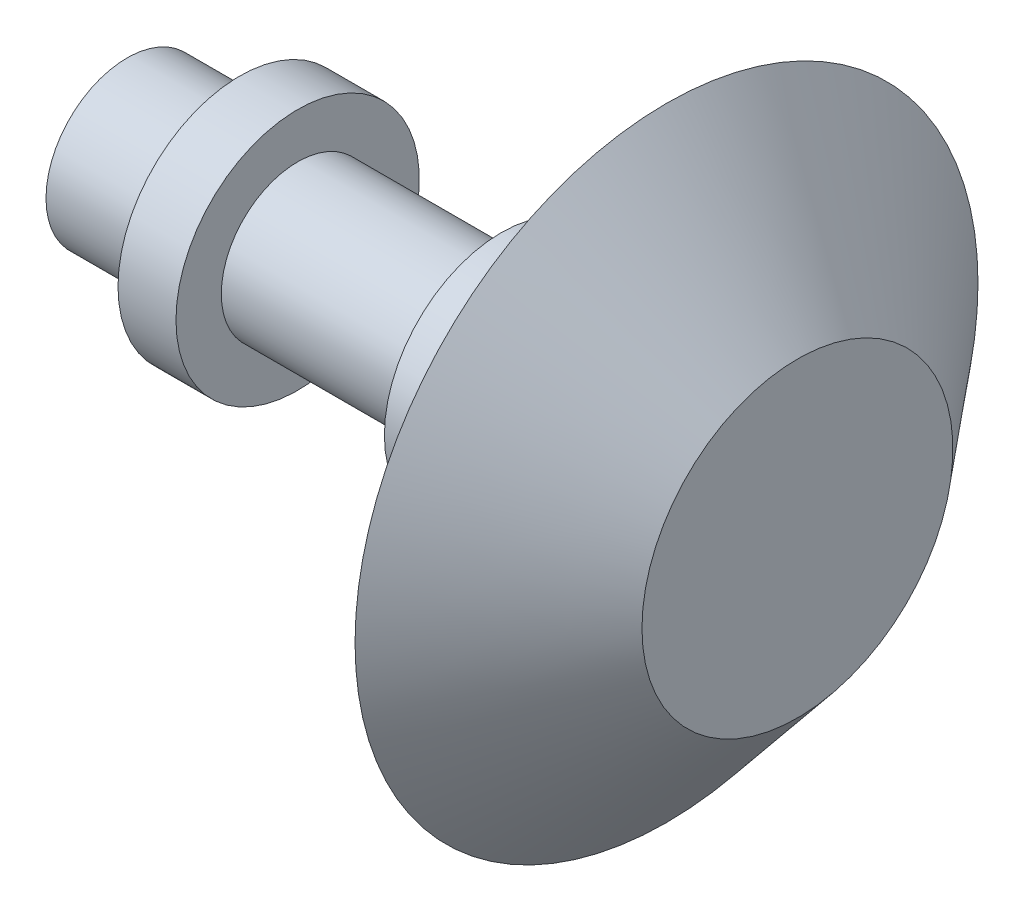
from build123d import *


with BuildPart() as part:
    # Esquisse1 → R_volution1 (revolve)
    with BuildSketch(Plane.XY, mode=Mode.PRIVATE) as r_volution1_sk:
        Polygon((131.651199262, 0), (131.651199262, 30.535239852), (105.939115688, 61.177707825), (105.939115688, 15), (82.257103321, 15), (82.257103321, 22.966789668), (73.493634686, 22.966789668), (73.493634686, 15), (33.493634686, 15), (33.493634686, 23.900369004), (22.107841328, 23.900369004), (22.107841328, 15.933579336), (0, 15.933579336), (0, 0), align=None)
    revolve(r_volution1_sk.sketch.rotate(Axis((0, 0, 0), (1, 0, 0)), 90), axis=Axis((0, 0, 0), (1, 0, 0)))


solid = part.part
